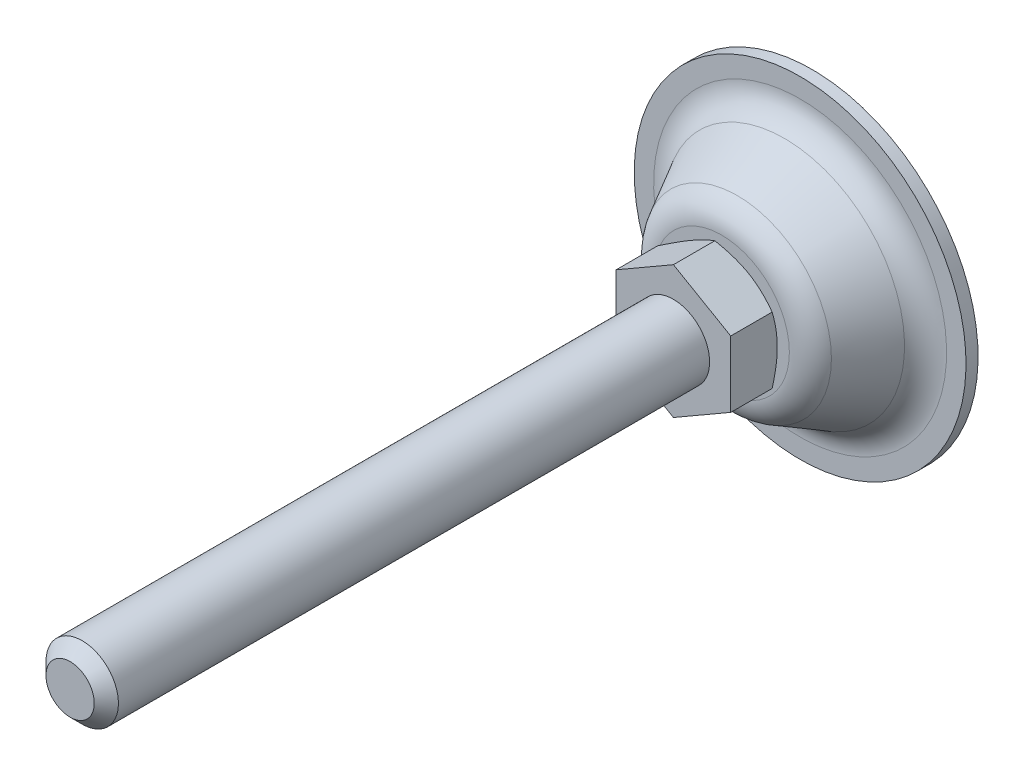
ISO-10303-21;
HEADER;
FILE_DESCRIPTION(('STEP AP214'),'2;1');
FILE_NAME('part.step','',(''),(''),'','','');
FILE_SCHEMA(('AUTOMOTIVE_DESIGN { 1 0 10303 214 1 1 1 1 }'));
ENDSEC;
DATA;
#1=APPLICATION_CONTEXT('core data for automotive mechanical design processes');
#2=APPLICATION_PROTOCOL_DEFINITION('international standard','automotive_design',2000,#1);
#3=PRODUCT_CONTEXT('',#1,'mechanical');
#4=PRODUCT('Part','Part','',(#3));
#5=PRODUCT_RELATED_PRODUCT_CATEGORY('part','',(#4));
#6=PRODUCT_DEFINITION_FORMATION('','',#4);
#7=PRODUCT_DEFINITION_CONTEXT('part definition',#1,'design');
#8=PRODUCT_DEFINITION('design','',#6,#7);
#9=PRODUCT_DEFINITION_SHAPE('','',#8);
#10=(LENGTH_UNIT() NAMED_UNIT(*) SI_UNIT(.MILLI.,.METRE.));
#11=(NAMED_UNIT(*) PLANE_ANGLE_UNIT() SI_UNIT($,.RADIAN.));
#12=(NAMED_UNIT(*) SI_UNIT($,.STERADIAN.) SOLID_ANGLE_UNIT());
#13=UNCERTAINTY_MEASURE_WITH_UNIT(LENGTH_MEASURE(1.E-05),#10,'distance_accuracy_value','');
#14=(GEOMETRIC_REPRESENTATION_CONTEXT(3) GLOBAL_UNCERTAINTY_ASSIGNED_CONTEXT((#13)) GLOBAL_UNIT_ASSIGNED_CONTEXT((#10,
#11,#12)) REPRESENTATION_CONTEXT('',''));
#15=CARTESIAN_POINT('',(0.,0.,0.));
#16=DIRECTION('',(0.,0.,1.));
#17=DIRECTION('',(1.,0.,0.));
#18=AXIS2_PLACEMENT_3D('',#15,#16,#17);
#19=CARTESIAN_POINT('',(0.,0.,23.));
#20=DIRECTION('',(0.,0.,1.));
#21=DIRECTION('',(0.5,-0.866025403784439,0.));
#22=AXIS2_PLACEMENT_3D('',#19,#20,#21);
#23=PLANE('',#22);
#24=DIRECTION('',(0.,1.,0.));
#25=VECTOR('',#24,1.);
#26=CARTESIAN_POINT('',(9.5,-5.48482755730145,23.));
#27=LINE('',#26,#25);
#28=CARTESIAN_POINT('',(9.5,-5.48482755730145,23.));
#29=VERTEX_POINT('',#28);
#30=CARTESIAN_POINT('',(9.5,5.48482755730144,23.));
#31=VERTEX_POINT('',#30);
#32=EDGE_CURVE('E218',#29,#31,#27,.T.);
#33=ORIENTED_EDGE('',*,*,#32,.T.);
#34=DIRECTION('',(-0.866025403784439,0.5,0.));
#35=VECTOR('',#34,1.);
#36=CARTESIAN_POINT('',(9.5,5.48482755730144,23.));
#37=LINE('',#36,#35);
#38=CARTESIAN_POINT('',(0.,10.9696551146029,23.));
#39=VERTEX_POINT('',#38);
#40=EDGE_CURVE('E359',#31,#39,#37,.T.);
#41=ORIENTED_EDGE('',*,*,#40,.T.);
#42=DIRECTION('',(-0.866025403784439,-0.5,0.));
#43=VECTOR('',#42,1.);
#44=CARTESIAN_POINT('',(0.,10.9696551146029,23.));
#45=LINE('',#44,#43);
#46=CARTESIAN_POINT('',(-9.5,5.48482755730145,23.));
#47=VERTEX_POINT('',#46);
#48=EDGE_CURVE('E358',#39,#47,#45,.T.);
#49=ORIENTED_EDGE('',*,*,#48,.T.);
#50=DIRECTION('',(0.,-1.,0.));
#51=VECTOR('',#50,1.);
#52=CARTESIAN_POINT('',(-9.5,5.48482755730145,23.));
#53=LINE('',#52,#51);
#54=CARTESIAN_POINT('',(-9.5,-5.48482755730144,23.));
#55=VERTEX_POINT('',#54);
#56=EDGE_CURVE('E363',#47,#55,#53,.T.);
#57=ORIENTED_EDGE('',*,*,#56,.T.);
#58=DIRECTION('',(0.866025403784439,-0.5,0.));
#59=VECTOR('',#58,1.);
#60=CARTESIAN_POINT('',(-9.5,-5.48482755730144,23.));
#61=LINE('',#60,#59);
#62=CARTESIAN_POINT('',(0.,-10.9696551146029,23.));
#63=VERTEX_POINT('',#62);
#64=EDGE_CURVE('E365',#55,#63,#61,.T.);
#65=ORIENTED_EDGE('',*,*,#64,.T.);
#66=DIRECTION('',(0.866025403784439,0.5,0.));
#67=VECTOR('',#66,1.);
#68=CARTESIAN_POINT('',(0.,-10.9696551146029,23.));
#69=LINE('',#68,#67);
#70=EDGE_CURVE('E37',#63,#29,#69,.T.);
#71=ORIENTED_EDGE('',*,*,#70,.T.);
#72=EDGE_LOOP('',(#33,#41,#49,#57,#65,#71));
#73=FACE_BOUND('',#72,.T.);
#74=CARTESIAN_POINT('',(0.,0.,23.));
#75=DIRECTION('',(0.,0.,1.));
#76=DIRECTION('',(0.5,-0.866025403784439,0.));
#77=AXIS2_PLACEMENT_3D('',#74,#75,#76);
#78=CIRCLE('',#77,6.);
#79=CARTESIAN_POINT('',(3.,-5.19615242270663,23.));
#80=VERTEX_POINT('',#79);
#81=EDGE_CURVE('E222',#80,#80,#78,.T.);
#82=ORIENTED_EDGE('',*,*,#81,.F.);
#83=EDGE_LOOP('',(#82));
#84=FACE_BOUND('',#83,.T.);
#85=ADVANCED_FACE('F14',(#73,#84),#23,.T.);
#86=CARTESIAN_POINT('',(0.,0.,15.));
#87=DIRECTION('',(0.,0.,1.));
#88=DIRECTION('',(0.5,-0.866025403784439,0.));
#89=AXIS2_PLACEMENT_3D('',#86,#87,#88);
#90=PLANE('',#89);
#91=CARTESIAN_POINT('',(0.,0.,15.));
#92=DIRECTION('',(0.,0.,-1.));
#93=DIRECTION('',(-0.5,0.866025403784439,0.));
#94=AXIS2_PLACEMENT_3D('',#91,#92,#93);
#95=CIRCLE('',#94,11.2198194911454);
#96=CARTESIAN_POINT('',(-5.60990974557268,9.71664870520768,15.));
#97=VERTEX_POINT('',#96);
#98=EDGE_CURVE('E102',#97,#97,#95,.T.);
#99=ORIENTED_EDGE('',*,*,#98,.F.);
#100=EDGE_LOOP('',(#99));
#101=FACE_BOUND('',#100,.T.);
#102=CARTESIAN_POINT('',(0.,0.,15.));
#103=DIRECTION('',(0.,0.,-1.));
#104=DIRECTION('',(-0.5,0.866025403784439,0.));
#105=AXIS2_PLACEMENT_3D('',#102,#103,#104);
#106=CIRCLE('',#105,9.);
#107=CARTESIAN_POINT('',(-4.5,7.79422863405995,15.));
#108=VERTEX_POINT('',#107);
#109=EDGE_CURVE('E84',#108,#108,#106,.T.);
#110=ORIENTED_EDGE('',*,*,#109,.T.);
#111=EDGE_LOOP('',(#110));
#112=FACE_BOUND('',#111,.T.);
#113=ADVANCED_FACE('F183',(#101,#112),#90,.T.);
#114=CARTESIAN_POINT('',(0.,0.,0.));
#115=DIRECTION('',(0.,0.,-1.));
#116=DIRECTION('',(-0.5,0.866025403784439,0.));
#117=AXIS2_PLACEMENT_3D('',#114,#115,#116);
#118=PLANE('',#117);
#119=CARTESIAN_POINT('',(0.,0.,0.));
#120=DIRECTION('',(0.,0.,-1.));
#121=DIRECTION('',(-0.5,0.866025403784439,0.));
#122=AXIS2_PLACEMENT_3D('',#119,#120,#121);
#123=CIRCLE('',#122,27.5);
#124=CARTESIAN_POINT('',(-13.75,23.8156986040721,0.));
#125=VERTEX_POINT('',#124);
#126=EDGE_CURVE('E73',#125,#125,#123,.T.);
#127=ORIENTED_EDGE('',*,*,#126,.T.);
#128=EDGE_LOOP('',(#127));
#129=FACE_BOUND('',#128,.T.);
#130=ADVANCED_FACE('F186',(#129),#118,.T.);
#131=CARTESIAN_POINT('',(0.,0.,-9.3525294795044));
#132=DIRECTION('',(0.,0.,-1.));
#133=DIRECTION('',(-0.5,0.866025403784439,0.));
#134=AXIS2_PLACEMENT_3D('',#131,#132,#133);
#135=CYLINDRICAL_SURFACE('',#134,27.5);
#136=CARTESIAN_POINT('',(0.,0.,2.));
#137=DIRECTION('',(0.,0.,-1.));
#138=DIRECTION('',(-0.5,0.866025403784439,0.));
#139=AXIS2_PLACEMENT_3D('',#136,#137,#138);
#140=CIRCLE('',#139,27.5);
#141=CARTESIAN_POINT('',(-13.75,23.8156986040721,2.));
#142=VERTEX_POINT('',#141);
#143=EDGE_CURVE('E114',#142,#142,#140,.T.);
#144=ORIENTED_EDGE('',*,*,#143,.T.);
#145=EDGE_LOOP('',(#144));
#146=FACE_BOUND('',#145,.T.);
#147=ORIENTED_EDGE('',*,*,#126,.F.);
#148=EDGE_LOOP('',(#147));
#149=FACE_BOUND('',#148,.T.);
#150=ADVANCED_FACE('F202',(#146,#149),#135,.T.);
#151=CARTESIAN_POINT('',(-13.75,23.8156986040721,2.));
#152=DIRECTION('',(0.,0.,1.));
#153=DIRECTION('',(0.5,-0.866025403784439,0.));
#154=AXIS2_PLACEMENT_3D('',#151,#152,#153);
#155=PLANE('',#154);
#156=CARTESIAN_POINT('',(0.,0.,2.));
#157=DIRECTION('',(0.,0.,-1.));
#158=DIRECTION('',(-0.5,0.866025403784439,0.));
#159=AXIS2_PLACEMENT_3D('',#156,#157,#158);
#160=CIRCLE('',#159,24.2801624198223);
#161=CARTESIAN_POINT('',(-12.1400812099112,21.0272374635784,2.));
#162=VERTEX_POINT('',#161);
#163=EDGE_CURVE('E111',#162,#162,#160,.T.);
#164=ORIENTED_EDGE('',*,*,#163,.T.);
#165=EDGE_LOOP('',(#164));
#166=FACE_BOUND('',#165,.T.);
#167=ORIENTED_EDGE('',*,*,#143,.F.);
#168=EDGE_LOOP('',(#167));
#169=FACE_BOUND('',#168,.T.);
#170=ADVANCED_FACE('F198',(#166,#169),#155,.T.);
#171=CARTESIAN_POINT('',(0.,0.,7.));
#172=DIRECTION('',(0.,0.,-1.));
#173=DIRECTION('',(-0.5,0.866025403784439,0.));
#174=AXIS2_PLACEMENT_3D('',#171,#172,#173);
#175=TOROIDAL_SURFACE('',#174,24.2801624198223,5.);
#176=CARTESIAN_POINT('',(0.,0.,4.59142577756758));
#177=DIRECTION('',(0.,0.,-1.));
#178=DIRECTION('',(-0.5,0.866025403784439,0.));
#179=AXIS2_PLACEMENT_3D('',#176,#177,#178);
#180=CIRCLE('',#179,19.8985222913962);
#181=CARTESIAN_POINT('',(-9.9492611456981,17.2326258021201,4.59142577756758));
#182=VERTEX_POINT('',#181);
#183=EDGE_CURVE('E108',#182,#182,#180,.T.);
#184=ORIENTED_EDGE('',*,*,#183,.T.);
#185=EDGE_LOOP('',(#184));
#186=FACE_BOUND('',#185,.T.);
#187=ORIENTED_EDGE('',*,*,#163,.F.);
#188=EDGE_LOOP('',(#187));
#189=FACE_BOUND('',#188,.T.);
#190=ADVANCED_FACE('F194',(#186,#189),#175,.F.);
#191=CARTESIAN_POINT('',(0.,0.,4.59142577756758));
#192=DIRECTION('',(0.,0.,-1.));
#193=DIRECTION('',(-0.5,0.866025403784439,0.));
#194=AXIS2_PLACEMENT_3D('',#191,#192,#193);
#195=CONICAL_SURFACE('',#194,19.8985222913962,0.50261051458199);
#196=CARTESIAN_POINT('',(0.,0.,12.4085742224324));
#197=DIRECTION('',(0.,0.,-1.));
#198=DIRECTION('',(-0.5,0.866025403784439,0.));
#199=AXIS2_PLACEMENT_3D('',#196,#197,#198);
#200=CIRCLE('',#199,15.6014596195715);
#201=CARTESIAN_POINT('',(-7.80072980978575,13.511260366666,12.4085742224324));
#202=VERTEX_POINT('',#201);
#203=EDGE_CURVE('E105',#202,#202,#200,.T.);
#204=ORIENTED_EDGE('',*,*,#203,.T.);
#205=EDGE_LOOP('',(#204));
#206=FACE_BOUND('',#205,.T.);
#207=ORIENTED_EDGE('',*,*,#183,.F.);
#208=EDGE_LOOP('',(#207));
#209=FACE_BOUND('',#208,.T.);
#210=ADVANCED_FACE('F190',(#206,#209),#195,.T.);
#211=CARTESIAN_POINT('',(0.,0.,10.));
#212=DIRECTION('',(0.,0.,-1.));
#213=DIRECTION('',(-0.5,0.866025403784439,0.));
#214=AXIS2_PLACEMENT_3D('',#211,#212,#213);
#215=TOROIDAL_SURFACE('',#214,11.2198194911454,5.);
#216=ORIENTED_EDGE('',*,*,#98,.T.);
#217=EDGE_LOOP('',(#216));
#218=FACE_BOUND('',#217,.T.);
#219=ORIENTED_EDGE('',*,*,#203,.F.);
#220=EDGE_LOOP('',(#219));
#221=FACE_BOUND('',#220,.T.);
#222=ADVANCED_FACE('F130',(#218,#221),#215,.T.);
#223=CARTESIAN_POINT('',(0.,0.,18.9793107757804));
#224=DIRECTION('',(0.,0.,1.));
#225=DIRECTION('',(0.5,-0.866025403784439,0.));
#226=AXIS2_PLACEMENT_3D('',#223,#224,#225);
#227=CONICAL_SURFACE('',#226,15.8923684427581,1.0471975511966);
#228=ORIENTED_EDGE('',*,*,#109,.F.);
#229=EDGE_LOOP('',(#228));
#230=FACE_BOUND('',#229,.T.);
#231=CARTESIAN_POINT('',(-8.15701159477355,-15.6791079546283,20.0079523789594));
#232=CARTESIAN_POINT('',(-7.97671168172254,-15.5750117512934,19.9065949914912));
#233=CARTESIAN_POINT('',(-7.79620414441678,-15.4707956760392,19.8057302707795));
#234=CARTESIAN_POINT('',(-7.43473055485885,-15.262098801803,19.6050974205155));
#235=CARTESIAN_POINT('',(-7.25376449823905,-15.1576180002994,19.5053293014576));
#236=CARTESIAN_POINT('',(-6.71006743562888,-14.8437143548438,19.2078115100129));
#237=CARTESIAN_POINT('',(-6.34658864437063,-14.6338597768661,19.0118772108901));
#238=CARTESIAN_POINT('',(-5.6153393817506,-14.2116728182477,18.6249838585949));
#239=CARTESIAN_POINT('',(-5.24755640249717,-13.9993332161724,18.4340562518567));
#240=CARTESIAN_POINT('',(-4.5091170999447,-13.5729950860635,18.059786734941));
#241=CARTESIAN_POINT('',(-4.13846090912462,-13.3589966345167,17.8764444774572));
#242=CARTESIAN_POINT('',(-3.38118032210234,-12.9217804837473,17.5133517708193));
#243=CARTESIAN_POINT('',(-2.99443761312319,-12.6984944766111,17.3339285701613));
#244=CARTESIAN_POINT('',(-2.21648353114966,-12.2493424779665,16.9882522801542));
#245=CARTESIAN_POINT('',(-1.82527167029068,-12.0234762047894,16.8220006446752));
#246=CARTESIAN_POINT('',(-1.03843766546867,-11.5691973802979,16.5069077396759));
#247=CARTESIAN_POINT('',(-0.642825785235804,-11.3407907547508,16.3580326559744));
#248=CARTESIAN_POINT('',(0.154057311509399,-10.8807100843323,16.0823550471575));
#249=CARTESIAN_POINT('',(0.555326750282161,-10.6490370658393,15.9555457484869));
#250=CARTESIAN_POINT('',(1.36156962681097,-10.1835525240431,15.730660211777));
#251=CARTESIAN_POINT('',(1.7665083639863,-9.94976103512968,15.6324225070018));
#252=CARTESIAN_POINT('',(2.37771950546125,-9.59687811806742,15.5106601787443));
#253=CARTESIAN_POINT('',(2.58210426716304,-9.47887652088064,15.4743368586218));
#254=CARTESIAN_POINT('',(2.99193920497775,-9.24225820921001,15.4109296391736));
#255=CARTESIAN_POINT('',(3.19738927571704,-9.12364155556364,15.3838448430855));
#256=CARTESIAN_POINT('',(3.60633071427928,-8.88753910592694,15.3398031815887));
#257=CARTESIAN_POINT('',(3.80981147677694,-8.77005943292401,15.3227155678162));
#258=CARTESIAN_POINT('',(4.21721696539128,-8.53484376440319,15.2984994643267));
#259=CARTESIAN_POINT('',(4.42114168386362,-8.41710777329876,15.2913708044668));
#260=CARTESIAN_POINT('',(4.82906985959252,-8.18159033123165,15.2872433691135));
#261=CARTESIAN_POINT('',(5.03307331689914,-8.06380888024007,15.2902446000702));
#262=CARTESIAN_POINT('',(5.44078563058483,-7.8284160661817,15.3063014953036));
#263=CARTESIAN_POINT('',(5.64449447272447,-7.71080471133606,15.3193576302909));
#264=CARTESIAN_POINT('',(6.12963344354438,-7.43070959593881,15.3621439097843));
#265=CARTESIAN_POINT('',(6.41077353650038,-7.26839328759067,15.3963598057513));
#266=CARTESIAN_POINT('',(6.97105016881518,-6.94491742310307,15.482114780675));
#267=CARTESIAN_POINT('',(7.25018644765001,-6.7837580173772,15.5336560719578));
#268=CARTESIAN_POINT('',(8.08422220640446,-6.30222724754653,15.7115431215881));
#269=CARTESIAN_POINT('',(8.63545892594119,-5.98397057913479,15.8611230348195));
#270=CARTESIAN_POINT('',(9.45994897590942,-5.50795102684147,16.1217474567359));
#271=CARTESIAN_POINT('',(9.73744916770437,-5.34773621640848,16.2159197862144));
#272=CARTESIAN_POINT('',(10.289756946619,-5.0288611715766,16.4143552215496));
#273=CARTESIAN_POINT('',(10.5645645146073,-4.87020094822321,16.5186183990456));
#274=CARTESIAN_POINT('',(11.1115689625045,-4.55438778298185,16.7355370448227));
#275=CARTESIAN_POINT('',(11.3837665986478,-4.39723440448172,16.8481899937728));
#276=CARTESIAN_POINT('',(11.9258880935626,-4.08424041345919,17.0805318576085));
#277=CARTESIAN_POINT('',(12.1958119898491,-3.92839977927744,17.2002206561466));
#278=CARTESIAN_POINT('',(12.8727098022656,-3.53759264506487,17.5088865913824));
#279=CARTESIAN_POINT('',(13.278374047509,-3.30338228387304,17.7016878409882));
#280=CARTESIAN_POINT('',(14.0858986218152,-2.83715775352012,18.0976682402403));
#281=CARTESIAN_POINT('',(14.4877586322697,-2.60514376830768,18.3008482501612));
#282=CARTESIAN_POINT('',(15.2884562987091,-2.14286075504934,18.7153364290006));
#283=CARTESIAN_POINT('',(15.6872930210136,-1.91259226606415,18.9266469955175));
#284=CARTESIAN_POINT('',(16.4823758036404,-1.45355100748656,19.3556165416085));
#285=CARTESIAN_POINT('',(16.8786219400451,-1.22477819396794,19.5732753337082));
#286=CARTESIAN_POINT('',(17.6695213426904,-0.768152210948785,20.0139591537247));
#287=CARTESIAN_POINT('',(18.0641717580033,-0.540300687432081,20.2369909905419));
#288=CARTESIAN_POINT('',(18.8517115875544,-0.0856143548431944,20.6871626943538));
#289=CARTESIAN_POINT('',(19.2446009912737,0.141220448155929,20.9143025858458));
#290=CARTESIAN_POINT('',(20.0288426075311,0.594002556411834,21.3718987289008));
#291=CARTESIAN_POINT('',(20.4201950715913,0.819950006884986,21.6023544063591));
#292=CARTESIAN_POINT('',(21.2016656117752,1.27113223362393,22.0660411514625));
#293=CARTESIAN_POINT('',(21.5917836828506,1.49636700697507,22.2992722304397));
#294=CARTESIAN_POINT('',(22.6873922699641,2.1289169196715,22.9583931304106));
#295=CARTESIAN_POINT('',(23.3916953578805,2.53554649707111,23.3869143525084));
#296=CARTESIAN_POINT('',(24.7977714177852,3.34734488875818,24.2495346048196));
#297=CARTESIAN_POINT('',(25.499544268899,3.75251363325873,24.6836338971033));
#298=CARTESIAN_POINT('',(26.8990618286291,4.56052547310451,25.5547677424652));
#299=CARTESIAN_POINT('',(27.5968123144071,4.96337190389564,25.991789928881));
#300=CARTESIAN_POINT('',(28.6422636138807,5.56696349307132,26.6497454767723));
#301=CARTESIAN_POINT('',(28.9905403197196,5.76804114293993,26.8694605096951));
#302=CARTESIAN_POINT('',(29.6867494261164,6.16999765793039,27.3096154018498));
#303=CARTESIAN_POINT('',(30.0346818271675,6.37087652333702,27.5300552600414));
#304=CARTESIAN_POINT('',(30.3824623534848,6.57166770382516,27.7508142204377));
#305=B_SPLINE_CURVE_WITH_KNOTS('',3,(#231,#232,#233,#234,#235,#236,#237,#238,#239,#240,#241,
#242,#243,#244,#245,#246,#247,#248,#249,#250,#251,#252,#253,#254,#255,#256,#257,#258,#259,#260,
#261,#262,#263,#264,#265,#266,#267,#268,#269,#270,#271,#272,#273,#274,#275,#276,#277,#278,#279,
#280,#281,#282,#283,#284,#285,#286,#287,#288,#289,#290,#291,#292,#293,#294,#295,#296,#297,#298,
#299,#300,#301,#302,#303,#304),.UNSPECIFIED.,.F.,.F.,(4,2,2,2,2,2,2,2,2,2,2,2,2,2,2,2,2,2,2,2,2,
2,2,2,2,2,2,2,2,2,2,2,2,2,2,2,4),(0.,0.694661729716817,1.3893301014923,2.77886384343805,
4.17567800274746,5.57242813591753,7.01607199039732,8.45987497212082,9.90081979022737,
11.3413214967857,12.7735168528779,13.4897108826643,14.2058353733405,14.9123716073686,
15.6188957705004,16.3254203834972,17.0319780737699,18.0107209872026,18.9895889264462,
20.9483275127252,21.9501834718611,22.9520465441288,23.9536099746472,24.9551568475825,
26.4746221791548,27.9942136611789,29.5142567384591,31.0342549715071,32.5562928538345,
34.0783398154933,35.6001263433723,37.1219190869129,39.8796363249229,42.6374836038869,
45.3872304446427,46.7620143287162,48.1367962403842),.UNSPECIFIED.);
#306=CARTESIAN_POINT('',(0.,-10.9696551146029,16.1371809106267));
#307=VERTEX_POINT('',#306);
#308=CARTESIAN_POINT('',(9.5,-5.48482755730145,16.1371809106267));
#309=VERTEX_POINT('',#308);
#310=EDGE_CURVE('E65',#307,#309,#305,.T.);
#311=ORIENTED_EDGE('',*,*,#310,.F.);
#312=CARTESIAN_POINT('',(-9.5002,-5.4847120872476,16.137247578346));
#313=CARTESIAN_POINT('',(-9.29136922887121,-5.60528058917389,16.0676485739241));
#314=CARTESIAN_POINT('',(-9.0817598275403,-5.72629863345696,16.001208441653));
#315=CARTESIAN_POINT('',(-8.66086011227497,-5.96930519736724,15.8755224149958));
#316=CARTESIAN_POINT('',(-8.44956926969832,-6.09129402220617,15.8162788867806));
#317=CARTESIAN_POINT('',(-7.81229220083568,-6.45922610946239,15.6504897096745));
#318=CARTESIAN_POINT('',(-7.38379023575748,-6.70662183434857,15.5561895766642));
#319=CARTESIAN_POINT('',(-6.74255666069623,-7.07683821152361,15.4456138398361));
#320=CARTESIAN_POINT('',(-6.53174078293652,-7.19855281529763,15.4141149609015));
#321=CARTESIAN_POINT('',(-6.10913296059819,-7.4425455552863,15.3612933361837));
#322=CARTESIAN_POINT('',(-5.89734099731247,-7.56482370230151,15.3399707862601));
#323=CARTESIAN_POINT('',(-5.47340378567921,-7.80958396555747,15.3080481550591));
#324=CARTESIAN_POINT('',(-5.26125925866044,-7.93206566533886,15.2974353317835));
#325=CARTESIAN_POINT('',(-4.83677424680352,-8.17714220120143,15.2871576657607));
#326=CARTESIAN_POINT('',(-4.62443376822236,-8.29973703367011,15.2874924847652));
#327=CARTESIAN_POINT('',(-4.22745800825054,-8.5289310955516,15.2983485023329));
#328=CARTESIAN_POINT('',(-4.04279470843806,-8.63554650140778,15.307545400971));
#329=CARTESIAN_POINT('',(-3.67389999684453,-8.84852796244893,15.3340405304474));
#330=CARTESIAN_POINT('',(-3.48966861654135,-8.95489399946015,15.3513393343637));
#331=CARTESIAN_POINT('',(-2.93768832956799,-9.27357996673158,15.4149796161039));
#332=CARTESIAN_POINT('',(-2.57091646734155,-9.48533580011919,15.4730570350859));
#333=CARTESIAN_POINT('',(-1.83348217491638,-9.91109368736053,15.618251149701));
#334=CARTESIAN_POINT('',(-1.46291385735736,-10.1250414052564,15.7059833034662));
#335=CARTESIAN_POINT('',(-0.727303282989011,-10.5497463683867,15.9050988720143));
#336=CARTESIAN_POINT('',(-0.362251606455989,-10.7605090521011,16.0164355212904));
#337=CARTESIAN_POINT('',(0.000200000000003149,-10.9697705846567,16.137247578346));
#338=B_SPLINE_CURVE_WITH_KNOTS('',3,(#312,#313,#314,#315,#316,#317,#318,#319,#320,#321,#322,
#323,#324,#325,#326,#327,#328,#329,#330,#331,#332,#333,#334,#335,#336,#337),.UNSPECIFIED.,.F.,
.F.,(4,2,2,2,2,2,2,2,2,2,2,2,4),(0.,0.752880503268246,1.50600787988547,3.01546870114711,
3.75167336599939,4.48789219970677,5.22323407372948,5.95855322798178,6.59868084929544,
7.238853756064,8.5201092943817,9.82978009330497,11.1368800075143),.UNSPECIFIED.);
#339=CARTESIAN_POINT('',(-9.5,-5.48482755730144,16.1371809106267));
#340=VERTEX_POINT('',#339);
#341=EDGE_CURVE('E68',#340,#307,#338,.T.);
#342=ORIENTED_EDGE('',*,*,#341,.F.);
#343=CARTESIAN_POINT('',(-9.5,5.48505849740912,16.137247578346));
#344=CARTESIAN_POINT('',(-9.5,5.24392149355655,16.0676485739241));
#345=CARTESIAN_POINT('',(-9.5,5.0018854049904,16.001208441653));
#346=CARTESIAN_POINT('',(-9.5,4.51587227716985,15.8755224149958));
#347=CARTESIAN_POINT('',(-9.5,4.27189462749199,15.8162788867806));
#348=CARTESIAN_POINT('',(-9.5,3.53603045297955,15.6504897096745));
#349=CARTESIAN_POINT('',(-9.5,3.04123900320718,15.5561895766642));
#350=CARTESIAN_POINT('',(-9.5,2.30080624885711,15.4456138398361));
#351=CARTESIAN_POINT('',(-9.5,2.05737704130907,15.4141149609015));
#352=CARTESIAN_POINT('',(-9.5,1.56939156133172,15.3612933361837));
#353=CARTESIAN_POINT('',(-9.5,1.3248352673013,15.3399707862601));
#354=CARTESIAN_POINT('',(-9.5,0.835314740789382,15.3080481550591));
#355=CARTESIAN_POINT('',(-9.5,0.590351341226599,15.2974353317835));
#356=CARTESIAN_POINT('',(-9.5,0.100198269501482,15.2871576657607));
#357=CARTESIAN_POINT('',(-9.5,-0.144991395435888,15.2874924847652));
#358=CARTESIAN_POINT('',(-9.5,-0.603379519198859,15.2983485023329));
#359=CARTESIAN_POINT('',(-9.5,-0.816610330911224,15.307545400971));
#360=CARTESIAN_POINT('',(-9.5,-1.24257325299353,15.3340405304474));
#361=CARTESIAN_POINT('',(-9.5,-1.45530532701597,15.3513393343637));
#362=CARTESIAN_POINT('',(-9.5,-2.09267726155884,15.4149796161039));
#363=CARTESIAN_POINT('',(-9.5,-2.51618892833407,15.4730570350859));
#364=CARTESIAN_POINT('',(-9.5,-3.36770470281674,15.618251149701));
#365=CARTESIAN_POINT('',(-9.5,-3.79560013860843,15.7059833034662));
#366=CARTESIAN_POINT('',(-9.5,-4.64501006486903,15.9050988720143));
#367=CARTESIAN_POINT('',(-9.5,-5.06653543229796,16.0164355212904));
#368=CARTESIAN_POINT('',(-9.5,-5.48505849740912,16.137247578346));
#369=B_SPLINE_CURVE_WITH_KNOTS('',3,(#343,#344,#345,#346,#347,#348,#349,#350,#351,#352,#353,
#354,#355,#356,#357,#358,#359,#360,#361,#362,#363,#364,#365,#366,#367,#368),.UNSPECIFIED.,.F.,
.F.,(4,2,2,2,2,2,2,2,2,2,2,2,4),(0.,0.752880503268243,1.50600787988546,3.01546870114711,
3.75167336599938,4.48789219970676,5.22323407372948,5.95855322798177,6.59868084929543,
7.23885375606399,8.5201092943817,9.82978009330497,11.1368800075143),.UNSPECIFIED.);
#370=CARTESIAN_POINT('',(-9.5,5.48482755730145,16.1371809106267));
#371=VERTEX_POINT('',#370);
#372=EDGE_CURVE('E83',#371,#340,#369,.T.);
#373=ORIENTED_EDGE('',*,*,#372,.F.);
#374=CARTESIAN_POINT('',(-17.6570115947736,0.775374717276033,20.0079523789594));
#375=CARTESIAN_POINT('',(-17.4767116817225,0.87947092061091,19.9065949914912));
#376=CARTESIAN_POINT('',(-17.2962041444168,0.98368699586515,19.8057302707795));
#377=CARTESIAN_POINT('',(-16.9347305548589,1.19238387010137,19.6050974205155));
#378=CARTESIAN_POINT('',(-16.7537644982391,1.29686467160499,19.5053293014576));
#379=CARTESIAN_POINT('',(-16.2100674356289,1.61076831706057,19.2078115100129));
#380=CARTESIAN_POINT('',(-15.8465886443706,1.82062289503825,19.0118772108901));
#381=CARTESIAN_POINT('',(-15.1153393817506,2.24280985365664,18.6249838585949));
#382=CARTESIAN_POINT('',(-14.7475564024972,2.45514945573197,18.4340562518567));
#383=CARTESIAN_POINT('',(-14.0091170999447,2.88148758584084,18.059786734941));
#384=CARTESIAN_POINT('',(-13.6384609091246,3.09548603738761,17.8764444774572));
#385=CARTESIAN_POINT('',(-12.8811803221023,3.532702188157,17.5133517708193));
#386=CARTESIAN_POINT('',(-12.4944376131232,3.75598819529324,17.3339285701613));
#387=CARTESIAN_POINT('',(-11.7164835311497,4.20514019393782,16.9882522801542));
#388=CARTESIAN_POINT('',(-11.3252716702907,4.43100646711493,16.8220006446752));
#389=CARTESIAN_POINT('',(-10.5384376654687,4.88528529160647,16.5069077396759));
#390=CARTESIAN_POINT('',(-10.1428257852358,5.11369191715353,16.3580326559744));
#391=CARTESIAN_POINT('',(-9.3459426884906,5.57377258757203,16.0823550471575));
#392=CARTESIAN_POINT('',(-8.94467324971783,5.80544560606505,15.9555457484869));
#393=CARTESIAN_POINT('',(-8.13843037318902,6.27093014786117,15.730660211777));
#394=CARTESIAN_POINT('',(-7.73349163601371,6.50472163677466,15.6324225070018));
#395=CARTESIAN_POINT('',(-7.12228049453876,6.85760455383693,15.5106601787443));
#396=CARTESIAN_POINT('',(-6.91789573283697,6.97560615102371,15.4743368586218));
#397=CARTESIAN_POINT('',(-6.50806079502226,7.21222446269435,15.4109296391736));
#398=CARTESIAN_POINT('',(-6.30261072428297,7.33084111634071,15.3838448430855));
#399=CARTESIAN_POINT('',(-5.89366928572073,7.56694356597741,15.3398031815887));
#400=CARTESIAN_POINT('',(-5.69018852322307,7.68442323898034,15.3227155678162));
#401=CARTESIAN_POINT('',(-5.28278303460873,7.91963890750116,15.2984994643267));
#402=CARTESIAN_POINT('',(-5.07885831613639,8.03737489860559,15.2913708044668));
#403=CARTESIAN_POINT('',(-4.67093014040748,8.2728923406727,15.2872433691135));
#404=CARTESIAN_POINT('',(-4.46692668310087,8.39067379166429,15.2902446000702));
#405=CARTESIAN_POINT('',(-4.05921436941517,8.62606660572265,15.3063014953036));
#406=CARTESIAN_POINT('',(-3.85550552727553,8.74367796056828,15.3193576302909));
#407=CARTESIAN_POINT('',(-3.37036655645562,9.02377307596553,15.3621439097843));
#408=CARTESIAN_POINT('',(-3.08922646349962,9.18608938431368,15.3963598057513));
#409=CARTESIAN_POINT('',(-2.52894983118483,9.50956524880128,15.482114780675));
#410=CARTESIAN_POINT('',(-2.24981355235,9.67072465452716,15.5336560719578));
#411=CARTESIAN_POINT('',(-1.41577779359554,10.1522554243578,15.7115431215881));
#412=CARTESIAN_POINT('',(-0.864541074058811,10.4705120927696,15.8611230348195));
#413=CARTESIAN_POINT('',(-0.0400510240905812,10.9465316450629,16.1217474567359));
#414=CARTESIAN_POINT('',(0.237449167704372,11.1067464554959,16.2159197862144));
#415=CARTESIAN_POINT('',(0.789756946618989,11.4256215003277,16.4143552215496));
#416=CARTESIAN_POINT('',(1.06456451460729,11.5842817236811,16.5186183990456));
#417=CARTESIAN_POINT('',(1.61156896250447,11.9000948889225,16.7355370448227));
#418=CARTESIAN_POINT('',(1.88376659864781,12.0572482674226,16.8481899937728));
#419=CARTESIAN_POINT('',(2.42588809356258,12.3702422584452,17.0805318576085));
#420=CARTESIAN_POINT('',(2.69581198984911,12.5260828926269,17.2002206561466));
#421=CARTESIAN_POINT('',(3.37270980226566,12.9168900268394,17.5088865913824));
#422=CARTESIAN_POINT('',(3.77837404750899,13.1511003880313,17.7016878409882));
#423=CARTESIAN_POINT('',(4.5858986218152,13.6173249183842,18.0976682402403));
#424=CARTESIAN_POINT('',(4.98775863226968,13.8493389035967,18.3008482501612));
#425=CARTESIAN_POINT('',(5.78845629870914,14.311621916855,18.7153364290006));
#426=CARTESIAN_POINT('',(6.18729302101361,14.5418904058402,18.9266469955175));
#427=CARTESIAN_POINT('',(6.98237580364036,15.0009316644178,19.3556165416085));
#428=CARTESIAN_POINT('',(7.37862194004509,15.2297044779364,19.5732753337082));
#429=CARTESIAN_POINT('',(8.16952134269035,15.6863304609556,20.0139591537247));
#430=CARTESIAN_POINT('',(8.56417175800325,15.9141819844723,20.2369909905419));
#431=CARTESIAN_POINT('',(9.35171158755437,16.3688683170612,20.6871626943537));
#432=CARTESIAN_POINT('',(9.74460099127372,16.5957031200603,20.9143025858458));
#433=CARTESIAN_POINT('',(10.5288426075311,17.0484852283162,21.3718987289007));
#434=CARTESIAN_POINT('',(10.9201950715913,17.2744326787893,21.6023544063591));
#435=CARTESIAN_POINT('',(11.7016656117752,17.7256149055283,22.0660411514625));
#436=CARTESIAN_POINT('',(12.0917836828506,17.9508496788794,22.2992722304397));
#437=CARTESIAN_POINT('',(13.1873922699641,18.5833995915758,22.9583931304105));
#438=CARTESIAN_POINT('',(13.8916953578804,18.9900291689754,23.3869143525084));
#439=CARTESIAN_POINT('',(15.2977714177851,19.8018275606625,24.2495346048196));
#440=CARTESIAN_POINT('',(15.999544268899,20.2069963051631,24.6836338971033));
#441=CARTESIAN_POINT('',(17.3990618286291,21.0150081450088,25.5547677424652));
#442=CARTESIAN_POINT('',(18.0968123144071,21.4178545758,25.991789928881));
#443=CARTESIAN_POINT('',(19.1422636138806,22.0214461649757,26.6497454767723));
#444=CARTESIAN_POINT('',(19.4905403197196,22.2225238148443,26.869460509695));
#445=CARTESIAN_POINT('',(20.1867494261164,22.6244803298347,27.3096154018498));
#446=CARTESIAN_POINT('',(20.5346818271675,22.8253591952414,27.5300552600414));
#447=CARTESIAN_POINT('',(20.8824623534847,23.0261503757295,27.7508142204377));
#448=B_SPLINE_CURVE_WITH_KNOTS('',3,(#374,#375,#376,#377,#378,#379,#380,#381,#382,#383,#384,
#385,#386,#387,#388,#389,#390,#391,#392,#393,#394,#395,#396,#397,#398,#399,#400,#401,#402,#403,
#404,#405,#406,#407,#408,#409,#410,#411,#412,#413,#414,#415,#416,#417,#418,#419,#420,#421,#422,
#423,#424,#425,#426,#427,#428,#429,#430,#431,#432,#433,#434,#435,#436,#437,#438,#439,#440,#441,
#442,#443,#444,#445,#446,#447),.UNSPECIFIED.,.F.,.F.,(4,2,2,2,2,2,2,2,2,2,2,2,2,2,2,2,2,2,2,2,2,
2,2,2,2,2,2,2,2,2,2,2,2,2,2,2,4),(0.,0.694661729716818,1.38933010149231,2.77886384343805,
4.17567800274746,5.57242813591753,7.01607199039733,8.45987497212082,9.90081979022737,
11.3413214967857,12.7735168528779,13.4897108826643,14.2058353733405,14.9123716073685,
15.6188957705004,16.3254203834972,17.0319780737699,18.0107209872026,18.9895889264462,
20.9483275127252,21.9501834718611,22.9520465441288,23.9536099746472,24.9551568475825,
26.4746221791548,27.9942136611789,29.5142567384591,31.0342549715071,32.5562928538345,
34.0783398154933,35.6001263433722,37.1219190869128,39.8796363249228,42.6374836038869,
45.3872304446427,46.7620143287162,48.1367962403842),.UNSPECIFIED.);
#449=CARTESIAN_POINT('',(0.,10.9696551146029,16.1371809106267));
#450=VERTEX_POINT('',#449);
#451=EDGE_CURVE('E152',#450,#371,#448,.F.);
#452=ORIENTED_EDGE('',*,*,#451,.F.);
#453=CARTESIAN_POINT('',(9.5002,5.4847120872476,16.137247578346));
#454=CARTESIAN_POINT('',(9.29136922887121,5.60528058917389,16.0676485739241));
#455=CARTESIAN_POINT('',(9.0817598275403,5.72629863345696,16.001208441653));
#456=CARTESIAN_POINT('',(8.66086011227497,5.96930519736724,15.8755224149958));
#457=CARTESIAN_POINT('',(8.44956926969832,6.09129402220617,15.8162788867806));
#458=CARTESIAN_POINT('',(7.81229220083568,6.45922610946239,15.6504897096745));
#459=CARTESIAN_POINT('',(7.38379023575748,6.70662183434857,15.5561895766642));
#460=CARTESIAN_POINT('',(6.74255666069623,7.07683821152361,15.4456138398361));
#461=CARTESIAN_POINT('',(6.53174078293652,7.19855281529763,15.4141149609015));
#462=CARTESIAN_POINT('',(6.10913296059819,7.4425455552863,15.3612933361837));
#463=CARTESIAN_POINT('',(5.89734099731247,7.56482370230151,15.3399707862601));
#464=CARTESIAN_POINT('',(5.47340378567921,7.80958396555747,15.3080481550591));
#465=CARTESIAN_POINT('',(5.26125925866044,7.93206566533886,15.2974353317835));
#466=CARTESIAN_POINT('',(4.83677424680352,8.17714220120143,15.2871576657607));
#467=CARTESIAN_POINT('',(4.62443376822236,8.29973703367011,15.2874924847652));
#468=CARTESIAN_POINT('',(4.22745800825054,8.5289310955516,15.2983485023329));
#469=CARTESIAN_POINT('',(4.04279470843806,8.63554650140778,15.307545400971));
#470=CARTESIAN_POINT('',(3.67389999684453,8.84852796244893,15.3340405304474));
#471=CARTESIAN_POINT('',(3.48966861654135,8.95489399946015,15.3513393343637));
#472=CARTESIAN_POINT('',(2.93768832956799,9.27357996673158,15.4149796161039));
#473=CARTESIAN_POINT('',(2.57091646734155,9.48533580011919,15.4730570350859));
#474=CARTESIAN_POINT('',(1.83348217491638,9.91109368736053,15.618251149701));
#475=CARTESIAN_POINT('',(1.46291385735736,10.1250414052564,15.7059833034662));
#476=CARTESIAN_POINT('',(0.727303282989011,10.5497463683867,15.9050988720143));
#477=CARTESIAN_POINT('',(0.362251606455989,10.7605090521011,16.0164355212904));
#478=CARTESIAN_POINT('',(-0.000200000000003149,10.9697705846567,16.137247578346));
#479=B_SPLINE_CURVE_WITH_KNOTS('',3,(#453,#454,#455,#456,#457,#458,#459,#460,#461,#462,#463,
#464,#465,#466,#467,#468,#469,#470,#471,#472,#473,#474,#475,#476,#477,#478),.UNSPECIFIED.,.F.,
.F.,(4,2,2,2,2,2,2,2,2,2,2,2,4),(0.,0.752880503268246,1.50600787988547,3.01546870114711,
3.75167336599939,4.48789219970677,5.22323407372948,5.95855322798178,6.59868084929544,
7.238853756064,8.5201092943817,9.82978009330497,11.1368800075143),.UNSPECIFIED.);
#480=CARTESIAN_POINT('',(9.5,5.48482755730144,16.1371809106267));
#481=VERTEX_POINT('',#480);
#482=EDGE_CURVE('E159',#481,#450,#479,.T.);
#483=ORIENTED_EDGE('',*,*,#482,.F.);
#484=CARTESIAN_POINT('',(9.5,-5.48505849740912,16.137247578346));
#485=CARTESIAN_POINT('',(9.5,-5.24392149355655,16.0676485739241));
#486=CARTESIAN_POINT('',(9.5,-5.0018854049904,16.001208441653));
#487=CARTESIAN_POINT('',(9.5,-4.51587227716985,15.8755224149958));
#488=CARTESIAN_POINT('',(9.5,-4.27189462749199,15.8162788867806));
#489=CARTESIAN_POINT('',(9.5,-3.53603045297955,15.6504897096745));
#490=CARTESIAN_POINT('',(9.5,-3.04123900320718,15.5561895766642));
#491=CARTESIAN_POINT('',(9.5,-2.3008062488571,15.4456138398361));
#492=CARTESIAN_POINT('',(9.5,-2.05737704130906,15.4141149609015));
#493=CARTESIAN_POINT('',(9.5,-1.56939156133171,15.3612933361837));
#494=CARTESIAN_POINT('',(9.5,-1.32483526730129,15.3399707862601));
#495=CARTESIAN_POINT('',(9.5,-0.835314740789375,15.3080481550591));
#496=CARTESIAN_POINT('',(9.5,-0.590351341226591,15.2974353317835));
#497=CARTESIAN_POINT('',(9.5,-0.100198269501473,15.2871576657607));
#498=CARTESIAN_POINT('',(9.5,0.144991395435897,15.2874924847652));
#499=CARTESIAN_POINT('',(9.5,0.603379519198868,15.2983485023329));
#500=CARTESIAN_POINT('',(9.5,0.816610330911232,15.307545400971));
#501=CARTESIAN_POINT('',(9.5,1.24257325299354,15.3340405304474));
#502=CARTESIAN_POINT('',(9.5,1.45530532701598,15.3513393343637));
#503=CARTESIAN_POINT('',(9.5,2.09267726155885,15.4149796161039));
#504=CARTESIAN_POINT('',(9.5,2.51618892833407,15.4730570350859));
#505=CARTESIAN_POINT('',(9.5,3.36770470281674,15.618251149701));
#506=CARTESIAN_POINT('',(9.5,3.79560013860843,15.7059833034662));
#507=CARTESIAN_POINT('',(9.5,4.64501006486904,15.9050988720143));
#508=CARTESIAN_POINT('',(9.5,5.06653543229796,16.0164355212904));
#509=CARTESIAN_POINT('',(9.5,5.48505849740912,16.137247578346));
#510=B_SPLINE_CURVE_WITH_KNOTS('',3,(#484,#485,#486,#487,#488,#489,#490,#491,#492,#493,#494,
#495,#496,#497,#498,#499,#500,#501,#502,#503,#504,#505,#506,#507,#508,#509),.UNSPECIFIED.,.F.,
.F.,(4,2,2,2,2,2,2,2,2,2,2,2,4),(0.,0.752880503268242,1.50600787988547,3.01546870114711,
3.75167336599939,4.48789219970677,5.22323407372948,5.95855322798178,6.59868084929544,
7.238853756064,8.5201092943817,9.82978009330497,11.1368800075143),.UNSPECIFIED.);
#511=EDGE_CURVE('E29',#309,#481,#510,.T.);
#512=ORIENTED_EDGE('',*,*,#511,.F.);
#513=EDGE_LOOP('',(#311,#342,#373,#452,#483,#512));
#514=FACE_BOUND('',#513,.T.);
#515=ADVANCED_FACE('F67',(#230,#514),#227,.T.);
#516=CARTESIAN_POINT('',(0.,-10.9696551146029,23.));
#517=DIRECTION('',(-0.5,0.866025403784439,0.));
#518=DIRECTION('',(0.,0.,1.));
#519=AXIS2_PLACEMENT_3D('',#516,#517,#518);
#520=PLANE('',#519);
#521=DIRECTION('',(0.,0.,-1.));
#522=VECTOR('',#521,1.);
#523=CARTESIAN_POINT('',(0.,-10.9696551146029,23.));
#524=LINE('',#523,#522);
#525=EDGE_CURVE('E80',#63,#307,#524,.T.);
#526=ORIENTED_EDGE('',*,*,#525,.T.);
#527=ORIENTED_EDGE('',*,*,#310,.T.);
#528=DIRECTION('',(0.,0.,-1.));
#529=VECTOR('',#528,1.);
#530=CARTESIAN_POINT('',(9.5,-5.48482755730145,23.));
#531=LINE('',#530,#529);
#532=EDGE_CURVE('E87',#29,#309,#531,.T.);
#533=ORIENTED_EDGE('',*,*,#532,.F.);
#534=ORIENTED_EDGE('',*,*,#70,.F.);
#535=EDGE_LOOP('',(#526,#527,#533,#534));
#536=FACE_BOUND('',#535,.T.);
#537=ADVANCED_FACE('F86',(#536),#520,.F.);
#538=CARTESIAN_POINT('',(-9.5,-5.48482755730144,23.));
#539=DIRECTION('',(0.5,0.866025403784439,0.));
#540=DIRECTION('',(-0.866025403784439,0.5,0.));
#541=AXIS2_PLACEMENT_3D('',#538,#539,#540);
#542=PLANE('',#541);
#543=DIRECTION('',(0.,0.,-1.));
#544=VECTOR('',#543,1.);
#545=CARTESIAN_POINT('',(-9.5,-5.48482755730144,23.));
#546=LINE('',#545,#544);
#547=EDGE_CURVE('E82',#55,#340,#546,.T.);
#548=ORIENTED_EDGE('',*,*,#547,.T.);
#549=ORIENTED_EDGE('',*,*,#341,.T.);
#550=ORIENTED_EDGE('',*,*,#525,.F.);
#551=ORIENTED_EDGE('',*,*,#64,.F.);
#552=EDGE_LOOP('',(#548,#549,#550,#551));
#553=FACE_BOUND('',#552,.T.);
#554=ADVANCED_FACE('F78',(#553),#542,.F.);
#555=CARTESIAN_POINT('',(-9.5,5.48482755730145,23.));
#556=DIRECTION('',(1.,0.,0.));
#557=DIRECTION('',(0.,1.,0.));
#558=AXIS2_PLACEMENT_3D('',#555,#556,#557);
#559=PLANE('',#558);
#560=DIRECTION('',(0.,0.,-1.));
#561=VECTOR('',#560,1.);
#562=CARTESIAN_POINT('',(-9.5,5.48482755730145,23.));
#563=LINE('',#562,#561);
#564=EDGE_CURVE('E89',#47,#371,#563,.T.);
#565=ORIENTED_EDGE('',*,*,#564,.T.);
#566=ORIENTED_EDGE('',*,*,#372,.T.);
#567=ORIENTED_EDGE('',*,*,#547,.F.);
#568=ORIENTED_EDGE('',*,*,#56,.F.);
#569=EDGE_LOOP('',(#565,#566,#567,#568));
#570=FACE_BOUND('',#569,.T.);
#571=ADVANCED_FACE('F336',(#570),#559,.F.);
#572=CARTESIAN_POINT('',(0.,10.9696551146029,23.));
#573=DIRECTION('',(0.5,-0.866025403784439,0.));
#574=DIRECTION('',(0.,0.,-1.));
#575=AXIS2_PLACEMENT_3D('',#572,#573,#574);
#576=PLANE('',#575);
#577=DIRECTION('',(0.,0.,-1.));
#578=VECTOR('',#577,1.);
#579=CARTESIAN_POINT('',(0.,10.9696551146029,23.));
#580=LINE('',#579,#578);
#581=EDGE_CURVE('E96',#39,#450,#580,.T.);
#582=ORIENTED_EDGE('',*,*,#581,.T.);
#583=ORIENTED_EDGE('',*,*,#451,.T.);
#584=ORIENTED_EDGE('',*,*,#564,.F.);
#585=ORIENTED_EDGE('',*,*,#48,.F.);
#586=EDGE_LOOP('',(#582,#583,#584,#585));
#587=FACE_BOUND('',#586,.T.);
#588=ADVANCED_FACE('F176',(#587),#576,.F.);
#589=CARTESIAN_POINT('',(9.5,5.48482755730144,23.));
#590=DIRECTION('',(-0.5,-0.866025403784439,0.));
#591=DIRECTION('',(0.866025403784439,-0.5,0.));
#592=AXIS2_PLACEMENT_3D('',#589,#590,#591);
#593=PLANE('',#592);
#594=DIRECTION('',(0.,0.,-1.));
#595=VECTOR('',#594,1.);
#596=CARTESIAN_POINT('',(9.5,5.48482755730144,23.));
#597=LINE('',#596,#595);
#598=EDGE_CURVE('E99',#31,#481,#597,.T.);
#599=ORIENTED_EDGE('',*,*,#598,.T.);
#600=ORIENTED_EDGE('',*,*,#482,.T.);
#601=ORIENTED_EDGE('',*,*,#581,.F.);
#602=ORIENTED_EDGE('',*,*,#40,.F.);
#603=EDGE_LOOP('',(#599,#600,#601,#602));
#604=FACE_BOUND('',#603,.T.);
#605=ADVANCED_FACE('F172',(#604),#593,.F.);
#606=CARTESIAN_POINT('',(9.5,-5.48482755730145,23.));
#607=DIRECTION('',(-1.,0.,0.));
#608=DIRECTION('',(0.,-1.,0.));
#609=AXIS2_PLACEMENT_3D('',#606,#607,#608);
#610=PLANE('',#609);
#611=ORIENTED_EDGE('',*,*,#532,.T.);
#612=ORIENTED_EDGE('',*,*,#511,.T.);
#613=ORIENTED_EDGE('',*,*,#598,.F.);
#614=ORIENTED_EDGE('',*,*,#32,.F.);
#615=EDGE_LOOP('',(#611,#612,#613,#614));
#616=FACE_BOUND('',#615,.T.);
#617=ADVANCED_FACE('F175',(#616),#610,.F.);
#618=CARTESIAN_POINT('',(0.,0.,123.));
#619=DIRECTION('',(0.,0.,-1.));
#620=DIRECTION('',(-0.5,0.866025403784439,0.));
#621=AXIS2_PLACEMENT_3D('',#618,#619,#620);
#622=CYLINDRICAL_SURFACE('',#621,6.);
#623=CARTESIAN_POINT('',(0.,0.,121.));
#624=DIRECTION('',(0.,0.,1.));
#625=DIRECTION('',(0.5,-0.866025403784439,0.));
#626=AXIS2_PLACEMENT_3D('',#623,#624,#625);
#627=CIRCLE('',#626,6.);
#628=CARTESIAN_POINT('',(3.,-5.19615242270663,121.));
#629=VERTEX_POINT('',#628);
#630=EDGE_CURVE('E9',#629,#629,#627,.F.);
#631=ORIENTED_EDGE('',*,*,#630,.T.);
#632=EDGE_LOOP('',(#631));
#633=FACE_BOUND('',#632,.T.);
#634=ORIENTED_EDGE('',*,*,#81,.T.);
#635=EDGE_LOOP('',(#634));
#636=FACE_BOUND('',#635,.T.);
#637=ADVANCED_FACE('F132',(#633,#636),#622,.T.);
#638=CARTESIAN_POINT('',(0.,0.,123.));
#639=DIRECTION('',(0.,0.,1.));
#640=DIRECTION('',(0.5,-0.866025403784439,0.));
#641=AXIS2_PLACEMENT_3D('',#638,#639,#640);
#642=PLANE('',#641);
#643=CARTESIAN_POINT('',(0.,0.,123.));
#644=DIRECTION('',(0.,0.,1.));
#645=DIRECTION('',(0.5,-0.866025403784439,0.));
#646=AXIS2_PLACEMENT_3D('',#643,#644,#645);
#647=CIRCLE('',#646,4.);
#648=CARTESIAN_POINT('',(2.,-3.46410161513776,123.));
#649=VERTEX_POINT('',#648);
#650=EDGE_CURVE('E22',#649,#649,#647,.T.);
#651=ORIENTED_EDGE('',*,*,#650,.T.);
#652=EDGE_LOOP('',(#651));
#653=FACE_BOUND('',#652,.T.);
#654=ADVANCED_FACE('F229',(#653),#642,.T.);
#655=CARTESIAN_POINT('',(0.,0.,123.));
#656=DIRECTION('',(0.,0.,-1.));
#657=DIRECTION('',(-0.5,0.866025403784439,0.));
#658=AXIS2_PLACEMENT_3D('',#655,#656,#657);
#659=CONICAL_SURFACE('',#658,4.,0.78539816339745);
#660=ORIENTED_EDGE('',*,*,#630,.F.);
#661=EDGE_LOOP('',(#660));
#662=FACE_BOUND('',#661,.T.);
#663=ORIENTED_EDGE('',*,*,#650,.F.);
#664=EDGE_LOOP('',(#663));
#665=FACE_BOUND('',#664,.T.);
#666=ADVANCED_FACE('F16',(#662,#665),#659,.T.);
#667=CLOSED_SHELL('',(#85,#113,#130,#150,#170,#190,#210,#222,#515,#537,#554,#571,#588,#605,#617,
#637,#654,#666));
#668=MANIFOLD_SOLID_BREP('B1',#667);
#669=ADVANCED_BREP_SHAPE_REPRESENTATION('',(#18,#668),#14);
#670=SHAPE_DEFINITION_REPRESENTATION(#9,#669);
ENDSEC;
END-ISO-10303-21;
